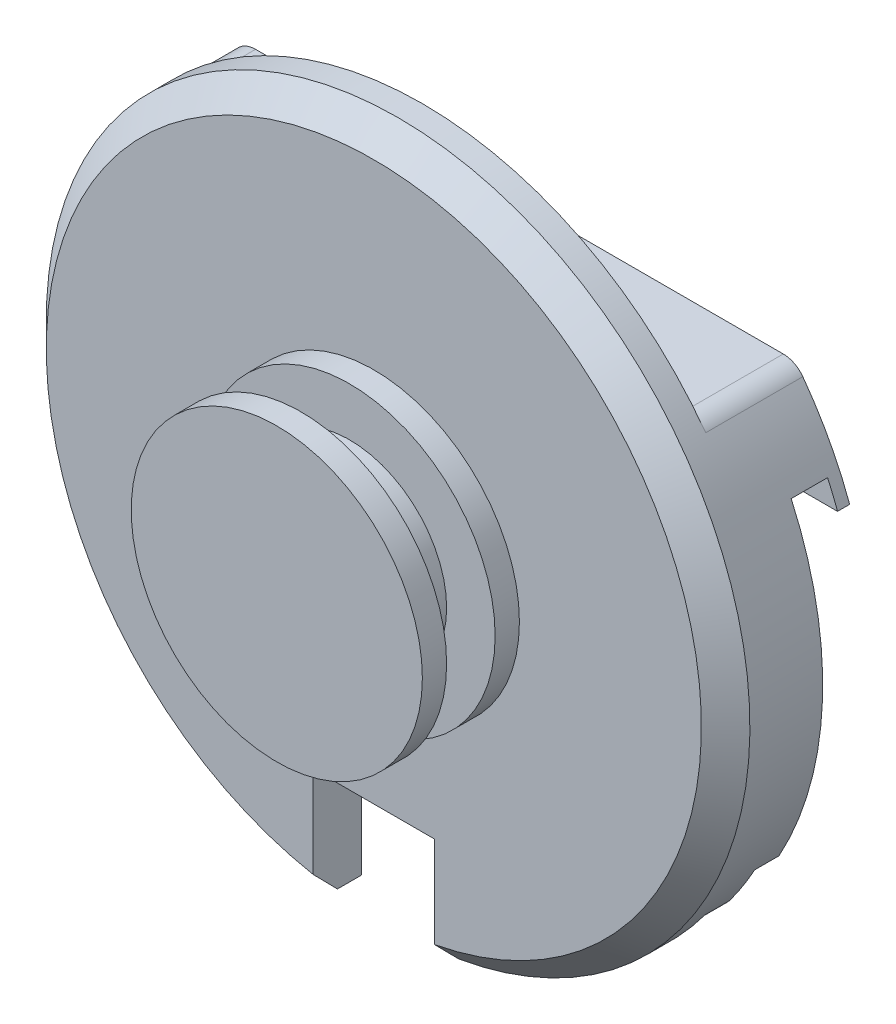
from build123d import *
from build123d.topology import SkipClean

# Parameters (mm, degrees)
SKETCH1_R                       = 14.5
EXTRUDE1_DEPTH                  = 2
CHAMFER1_SIZE                   = 1
SKETCH2_R                       = 6.000000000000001
EXTRUDE2_DEPTH                  = 1
SKETCH3_R                       = 4
EXTRUDE3_DEPTH                  = 2
SKETCH4_R                       = 6.000000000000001
EXTRUDE4_DEPTH                  = 1
EXTRUDE5_START                  = 2
EXTRUDE5_DEPTH                  = 2
SKETCH6_R                       = 2
CUT_EXTRUDE1_DEPTH              = 7
CUT_EXTRUDE1_DRAFT              = -5.000000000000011
EXTRUDE6_REACH                  = 23.366
EXTRUDE6_END_RADIUS             = 14.5
EXTRUDE6_DIRECTION_2_REACH      = 23.366
EXTRUDE6_DIRECTION_2_END_RADIUS = 14.5
EXTRUDE7_DEPTH                  = 6
EXTRUDE8_START                  = 1
EXTRUDE8_DEPTH                  = 1
EXTRUDE_THIN1_DEPTH             = 8
CUT_EXTRUDE3_DEPTH              = 30.449108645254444
FILLET1_R                       = 1


with BuildPart() as part:
    # Sketch1 → Extrude1 (new body)
    with BuildSketch(Plane.XY):
        Circle(SKETCH1_R)
    extrude(amount=EXTRUDE1_DEPTH)

    # Chamfer1
    chamfer1_edges = [part.edges().sort_by_distance(p)[0] for p in [
        (-14.5, 1.78e-15, 2),
    ]]
    chamfer(chamfer1_edges, length=CHAMFER1_SIZE)

    # Sketch2 → Extrude2 (add)
    with BuildSketch(Plane.XY.offset(2)):
        Circle(SKETCH2_R)
    extrude(amount=EXTRUDE2_DEPTH)

    # Sketch3 → Extrude3 (add)
    with BuildSketch(Plane.XY.offset(3)):
        Circle(SKETCH3_R)
    extrude(amount=EXTRUDE3_DEPTH)

    # Sketch4 → Extrude4 (add)
    with BuildSketch(Plane(origin=(0.38976539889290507, -0.9593258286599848, 4.999999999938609), x_dir=(1, 0, 0), z_dir=(0, 0, 1))):
        with Locations((-0.38976539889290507, 0.9593258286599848)):
            Circle(SKETCH4_R)
    extrude(amount=EXTRUDE4_DEPTH)

    # Sketch5 → Extrude5 (add)
    with BuildSketch(Plane(origin=(0, 0, 0), x_dir=(-1, 0, 0), z_dir=(0, 0, -1)).offset(EXTRUDE5_START)):
        with BuildLine():
            Line((-11.368817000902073, 9), (11.368817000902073, 9))
            ThreePointArc((11.368817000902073, 9), (14.450191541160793, 1.2008182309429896), (12.698425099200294, -7))
            Line((12.698425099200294, -7), (-12.698425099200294, -7))
            ThreePointArc((-12.698425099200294, -7), (-14.450191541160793, 1.200818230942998), (-11.368817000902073, 9))
        make_face()
    extrude(amount=-EXTRUDE5_DEPTH)


with BuildPart() as cut_extrude1_tool:
    # Sketch6 → Cut-Extrude1 (with draft: the straight prism first)
    with BuildSketch(Plane(origin=(0, 0, -2), x_dir=(-1, 0, 0), z_dir=(0, 0, -1))):
        Circle(SKETCH6_R)
    extrude(amount=-CUT_EXTRUDE1_DEPTH)
    # Cut-Extrude1: the draft: its side faces are tilted about the plane it starts from
    cut_extrude1_sides = [cut_extrude1_tool.faces().sort_by_distance(p)[0] for p in [
        (2, 0, 1.5),
    ]]
    draft(cut_extrude1_sides, Plane(origin=(0, 0, -2), x_dir=(-1, 0, 0), z_dir=(0, 0, -1)), CUT_EXTRUDE1_DRAFT)


with BuildPart() as part_1:
    add(part.part)

    # Cut-Extrude1: cut by cut_extrude1_tool
    add(cut_extrude1_tool.part, mode=Mode.SUBTRACT)

    # Extrude6: up to this cylinder (the profile starts inside it)
    with SkipClean():  # the faces are left unmerged after this step: merging them gives an invalid solid
        extrude6_end = Plane(origin=(0, 0, -3.0576919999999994), z_dir=(0, 0, -1)) * Cylinder(EXTRUDE6_END_RADIUS, 76.732, mode=Mode.PRIVATE)
        # Sketch7 → Extrude6 (add, up to the surface)
        with BuildSketch(Plane(origin=(0, 0, 0), x_dir=(0, 0, -1), z_dir=(1, 0, 0)), mode=Mode.PRIVATE) as extrude6_sk1:
            Polygon((2, 9), (4, 9.000000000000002), (4, 5.000000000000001), (3.5000000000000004, 5.000000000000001), (3.5000000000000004, 6), (2, 6), align=None)
        extrude6_tool1 = extrude(extrude6_sk1.sketch, amount=EXTRUDE6_REACH, mode=Mode.PRIVATE) & extrude6_end
        add(extrude6_tool1.solids().sort_by_distance((0, 7.346154, -3.057692))[0])

    # Extrude6 direction 2: up to this cylinder (the profile starts inside it)
    with SkipClean():  # the faces are left unmerged after this step: merging them gives an invalid solid
        extrude6_direction_2_end = Plane(origin=(0, 0, -3.0576919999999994), z_dir=(0, 0, -1)) * Cylinder(EXTRUDE6_DIRECTION_2_END_RADIUS, 76.732, mode=Mode.PRIVATE)
        # Sketch7 → Extrude6 direction 2 (add, up to the surface)
        with BuildSketch(Plane(origin=(0, 0, 0), x_dir=(0, 0, -1), z_dir=(1, 0, 0)), mode=Mode.PRIVATE) as extrude6_direction_2_sk1:
            Polygon((2, 9), (4, 9.000000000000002), (4, 5.000000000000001), (3.5000000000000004, 5.000000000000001), (3.5000000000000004, 6), (2, 6), align=None)
        extrude6_direction_2_tool1 = extrude(extrude6_direction_2_sk1.sketch, amount=-EXTRUDE6_DIRECTION_2_REACH, mode=Mode.PRIVATE) & extrude6_direction_2_end
        add(extrude6_direction_2_tool1.solids().sort_by_distance((0, 7.346154, -3.057692))[0])

    # Sketch8 → Extrude7 (add, symmetric)
    with SkipClean():  # the faces are left unmerged after this step: merging them gives an invalid solid
        with BuildSketch(Plane(origin=(0, 2.000000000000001, -5.5e-16), x_dir=(0, 0, -1), z_dir=(-1, 0, 0))):
            Polygon((4, 9.000000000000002), (2, 9), (2, 6), (3.5000000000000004, 6), (3.5000000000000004, 5.000000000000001), (4, 5.000000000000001), align=None)
        extrude(amount=EXTRUDE7_DEPTH, both=True)

    # Sketch9 → Extrude8 (add)
    with SkipClean():  # the faces are left unmerged after this step: merging them gives an invalid solid
        with BuildSketch(Plane(origin=(0, 0, 0), x_dir=(-1, 0, 0), z_dir=(0, 0, -1)).offset(EXTRUDE8_START)):
            with BuildLine():
                Line((-11.368817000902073, -9), (-6.499999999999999, -9))
                Line((-6.499999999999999, -9), (-6.499999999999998, -10))
                Line((-6.499999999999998, -10), (6.5, -9.999999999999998))
                Line((6.5, -9.999999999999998), (6.500000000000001, -8.999999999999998))
                Line((6.500000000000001, -8.999999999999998), (11.368817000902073, -9))
                ThreePointArc((11.368817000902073, -9), (12.075099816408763, -8.027575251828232), (12.698425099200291, -7.000000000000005))
                Line((12.698425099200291, -7.000000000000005), (-12.698425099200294, -7))
                ThreePointArc((-12.698425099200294, -7), (-12.075099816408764, -8.027575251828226), (-11.368817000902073, -9))
            make_face()
        extrude(amount=-EXTRUDE8_DEPTH)

    # Sketch10 → Extrude-Thin1 (add)
    with SkipClean():  # the faces are left unmerged after this step: merging them gives an invalid solid
        with BuildSketch(Plane(origin=(0, 0, -1), x_dir=(-1, 0, 0), z_dir=(0, 0, -1))):
            Polygon((-4.999999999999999, -8.499999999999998), (5.000000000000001, -8.499999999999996), (5.000000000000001, -9.499999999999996), (-4.999999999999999, -9.499999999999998), align=None)
        extrude(amount=EXTRUDE_THIN1_DEPTH)

    # Sketch11 → Cut-Extrude3 (cut, through all)
    with BuildSketch(Plane(origin=(-1.65e-15, -9.499999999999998, 0), x_dir=(-1, 9e-17, 0), z_dir=(9e-17, 1, 0))):
        Polygon((2.4999999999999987, 1.9999999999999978), (-2.4999999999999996, 1.9999999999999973), (-2.4999999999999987, -9.000000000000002), (2.5000000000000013, -9.000000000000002), align=None)
    extrude(amount=-CUT_EXTRUDE3_DEPTH, mode=Mode.SUBTRACT)

    # Fillet1
    fillet1_edges = [part_1.edges().sort_by_distance(p)[0] for p in [
        (11.368817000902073, -9, -0.5),
        (-11.368817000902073, -9, -0.5),
        (11.368817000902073, 9, -1),
        (-11.368817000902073, 9, -1),
    ]]
    fillet(fillet1_edges, radius=FILLET1_R)


solid = part_1.part
